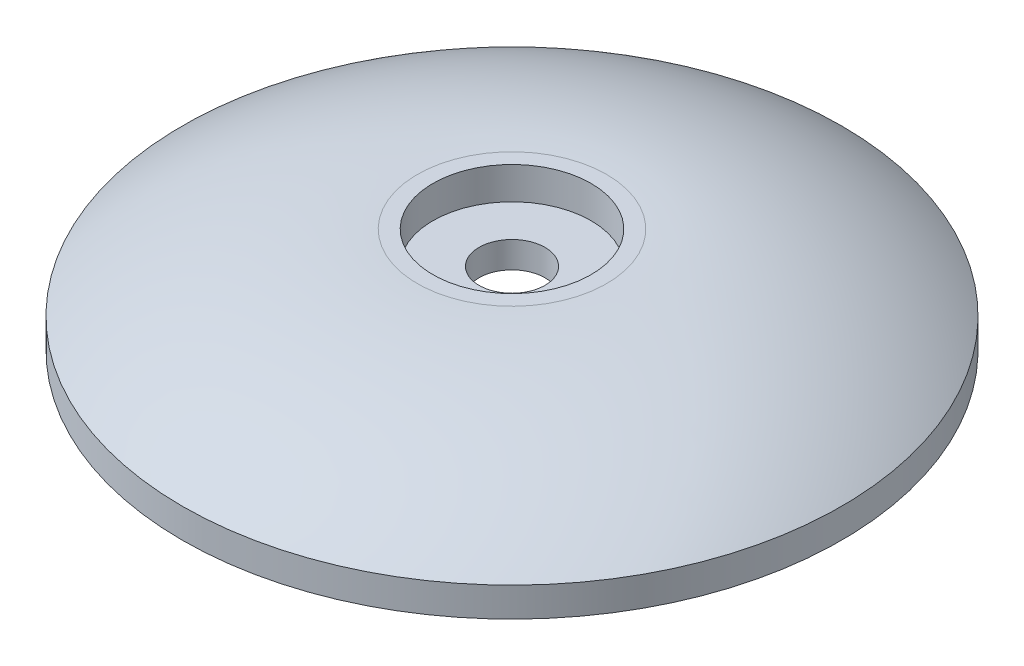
from build123d import *


with BuildPart() as part:
    # Sketch 1 → Revolve 1 (revolve)
    with BuildSketch(Plane.XY, mode=Mode.PRIVATE) as revolve_1_sk:
        with BuildLine():
            Line((10.1, -1.351603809), (10.1, 2.148396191))
            Line((10.1, 2.148396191), (6, 2.148396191))
            Line((6, 2.148396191), (2.5, 2.148396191))
            Line((2.5, 2.148396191), (2.5, 4.148396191))
            Line((2.5, 4.148396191), (6, 4.148396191))
            Line((6, 4.148396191), (6, 6.599822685))
            Line((6, 6.599822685), (7.178441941, 6.599822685))
            ThreePointArc((7.178441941, 6.599822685), (16.570213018, 5.240430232), (25, 0.882448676))
            Line((25, 0.882448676), (25, -1.351603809))
            Line((25, -1.351603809), (10.1, -1.351603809))
        make_face()
    revolve(revolve_1_sk.sketch.rotate(Axis((0, 0, 0), (0, 1, 0)), 90), axis=Axis((0, 0, 0), (0, 1, 0)))


solid = part.part
